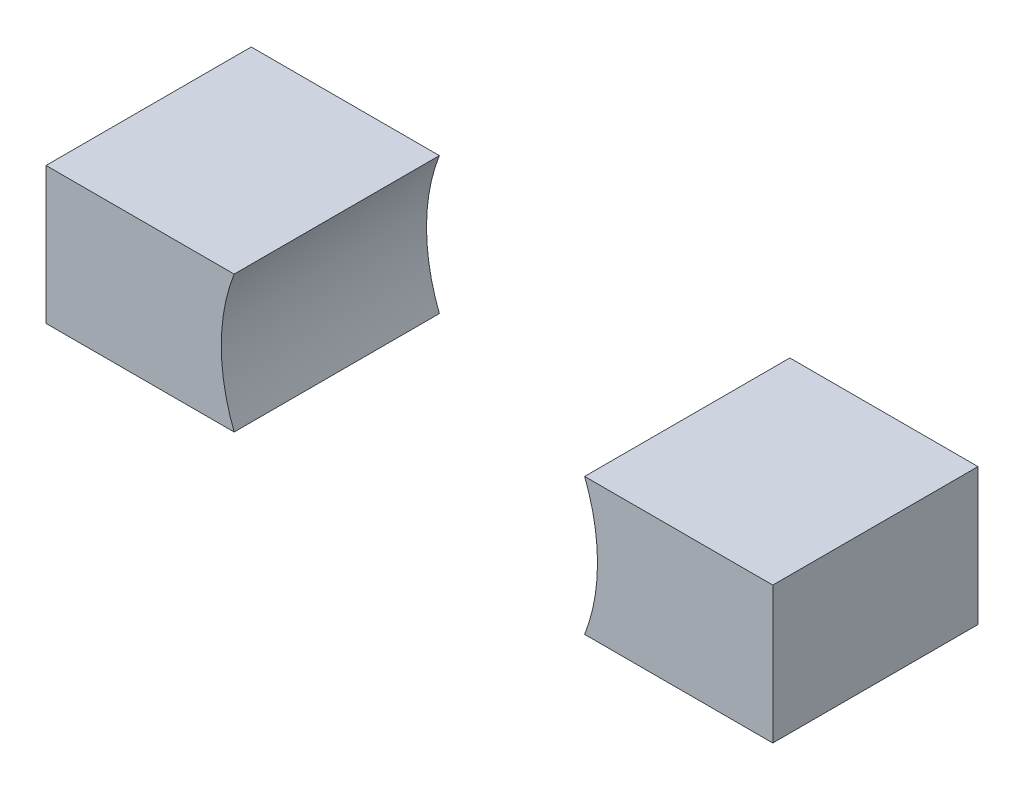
from build123d import *

# Parameters (mm, degrees)
CROQUIS1_W              = 42.5
CROQUIS1_H              = 8
SALIENTE_EXTRUIR1_DEPTH = 12
CROQUIS2_R              = 11
CORTAR_EXTRUIR1_DEPTH   = 45.880396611


with BuildPart() as part:
    # Croquis1 → Saliente-Extruir1 (new body)
    with BuildSketch(Plane.XY):
        with Locations((-21.25, 4)):
            Rectangle(CROQUIS1_W, CROQUIS1_H)
    extrude(amount=SALIENTE_EXTRUIR1_DEPTH)

    # Croquis2 → Cortar-Extruir1 (cut, through all)
    with BuildSketch(Plane.XY.offset(12)):
        with Locations((-21.25, 4)):
            Circle(CROQUIS2_R)
    extrude(amount=-CORTAR_EXTRUIR1_DEPTH, mode=Mode.SUBTRACT)


with BuildPart() as cortar_extruir1_piece_1:
    # of the separate pieces the step leaves, piece 1, a body of its own (cortar_extruir1_pieces)
    add(part.part.solids().sort_by_distance((-42.5, 8, 0))[0])


with BuildPart() as cortar_extruir1_piece_2:
    # of the separate pieces the step leaves, piece 2, a body of its own (cortar_extruir1_pieces)
    add(part.part.solids().sort_by_distance((-11.003049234, 8, 0))[0])


solid = Compound([cortar_extruir1_piece_1.part, cortar_extruir1_piece_2.part])
